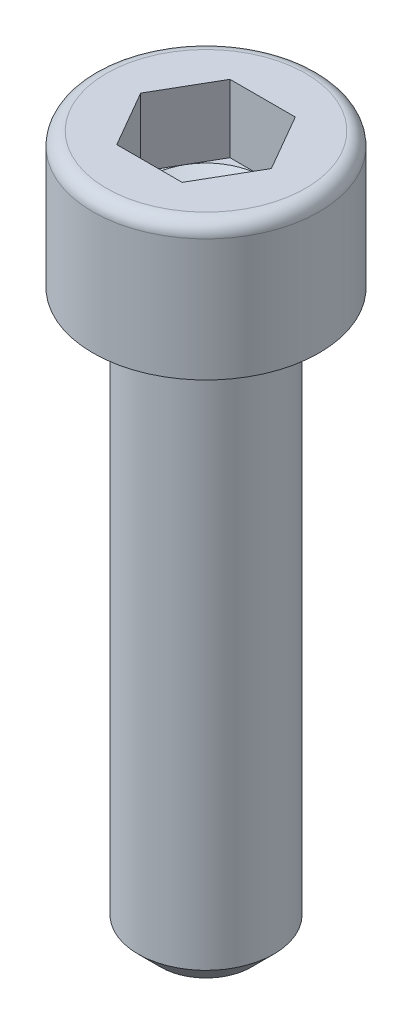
ISO-10303-21;
HEADER;
FILE_DESCRIPTION(('STEP AP214'),'2;1');
FILE_NAME('part.step','',(''),(''),'','','');
FILE_SCHEMA(('AUTOMOTIVE_DESIGN { 1 0 10303 214 1 1 1 1 }'));
ENDSEC;
DATA;
#1=APPLICATION_CONTEXT('core data for automotive mechanical design processes');
#2=APPLICATION_PROTOCOL_DEFINITION('international standard','automotive_design',2000,#1);
#3=PRODUCT_CONTEXT('',#1,'mechanical');
#4=PRODUCT('Part','Part','',(#3));
#5=PRODUCT_RELATED_PRODUCT_CATEGORY('part','',(#4));
#6=PRODUCT_DEFINITION_FORMATION('','',#4);
#7=PRODUCT_DEFINITION_CONTEXT('part definition',#1,'design');
#8=PRODUCT_DEFINITION('design','',#6,#7);
#9=PRODUCT_DEFINITION_SHAPE('','',#8);
#10=(LENGTH_UNIT() NAMED_UNIT(*) SI_UNIT(.MILLI.,.METRE.));
#11=(NAMED_UNIT(*) PLANE_ANGLE_UNIT() SI_UNIT($,.RADIAN.));
#12=(NAMED_UNIT(*) SI_UNIT($,.STERADIAN.) SOLID_ANGLE_UNIT());
#13=UNCERTAINTY_MEASURE_WITH_UNIT(LENGTH_MEASURE(1.E-05),#10,'distance_accuracy_value','');
#14=(GEOMETRIC_REPRESENTATION_CONTEXT(3) GLOBAL_UNCERTAINTY_ASSIGNED_CONTEXT((#13)) GLOBAL_UNIT_ASSIGNED_CONTEXT((#10,
#11,#12)) REPRESENTATION_CONTEXT('',''));
#15=CARTESIAN_POINT('',(0.,0.,0.));
#16=DIRECTION('',(0.,0.,1.));
#17=DIRECTION('',(1.,0.,0.));
#18=AXIS2_PLACEMENT_3D('',#15,#16,#17);
#19=CARTESIAN_POINT('',(2.5,6.,0.));
#20=DIRECTION('',(0.,-1.,0.));
#21=DIRECTION('',(1.,0.,0.));
#22=AXIS2_PLACEMENT_3D('',#19,#20,#21);
#23=PLANE('',#22);
#24=CARTESIAN_POINT('',(0.,6.,0.));
#25=DIRECTION('',(0.,1.,0.));
#26=DIRECTION('',(-1.,0.,0.));
#27=AXIS2_PLACEMENT_3D('',#24,#25,#26);
#28=CIRCLE('',#27,4.4);
#29=CARTESIAN_POINT('',(-4.4,6.,0.));
#30=VERTEX_POINT('',#29);
#31=EDGE_CURVE('E139',#30,#30,#28,.T.);
#32=ORIENTED_EDGE('',*,*,#31,.T.);
#33=EDGE_LOOP('',(#32));
#34=FACE_BOUND('',#33,.T.);
#35=DIRECTION('',(0.499999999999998,0.,0.86602540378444));
#36=VECTOR('',#35,1.);
#37=CARTESIAN_POINT('',(1.44337567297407,6.,-2.5));
#38=LINE('',#37,#36);
#39=CARTESIAN_POINT('',(1.44337567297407,6.,-2.5));
#40=VERTEX_POINT('',#39);
#41=CARTESIAN_POINT('',(2.88675134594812,6.,0.));
#42=VERTEX_POINT('',#41);
#43=EDGE_CURVE('E371',#40,#42,#38,.T.);
#44=ORIENTED_EDGE('',*,*,#43,.T.);
#45=DIRECTION('',(-0.499999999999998,0.,0.86602540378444));
#46=VECTOR('',#45,1.);
#47=CARTESIAN_POINT('',(1.44337567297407,6.,2.5));
#48=LINE('',#47,#46);
#49=CARTESIAN_POINT('',(1.44337567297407,6.,2.5));
#50=VERTEX_POINT('',#49);
#51=EDGE_CURVE('E374',#42,#50,#48,.T.);
#52=ORIENTED_EDGE('',*,*,#51,.T.);
#53=DIRECTION('',(-1.,0.,0.));
#54=VECTOR('',#53,1.);
#55=CARTESIAN_POINT('',(1.44337567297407,6.,2.5));
#56=LINE('',#55,#54);
#57=CARTESIAN_POINT('',(-1.44337567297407,6.,2.5));
#58=VERTEX_POINT('',#57);
#59=EDGE_CURVE('E377',#50,#58,#56,.T.);
#60=ORIENTED_EDGE('',*,*,#59,.T.);
#61=DIRECTION('',(-0.499999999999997,0.,-0.86602540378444));
#62=VECTOR('',#61,1.);
#63=CARTESIAN_POINT('',(-1.44337567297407,6.,2.5));
#64=LINE('',#63,#62);
#65=CARTESIAN_POINT('',(-2.88675134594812,6.,0.));
#66=VERTEX_POINT('',#65);
#67=EDGE_CURVE('E116',#58,#66,#64,.T.);
#68=ORIENTED_EDGE('',*,*,#67,.T.);
#69=DIRECTION('',(0.499999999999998,0.,-0.86602540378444));
#70=VECTOR('',#69,1.);
#71=CARTESIAN_POINT('',(-1.44337567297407,6.,-2.5));
#72=LINE('',#71,#70);
#73=CARTESIAN_POINT('',(-1.44337567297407,6.,-2.5));
#74=VERTEX_POINT('',#73);
#75=EDGE_CURVE('E368',#66,#74,#72,.T.);
#76=ORIENTED_EDGE('',*,*,#75,.T.);
#77=DIRECTION('',(1.,0.,0.));
#78=VECTOR('',#77,1.);
#79=CARTESIAN_POINT('',(1.44337567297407,6.,-2.5));
#80=LINE('',#79,#78);
#81=EDGE_CURVE('E127',#74,#40,#80,.T.);
#82=ORIENTED_EDGE('',*,*,#81,.T.);
#83=EDGE_LOOP('',(#44,#52,#60,#68,#76,#82));
#84=FACE_BOUND('',#83,.T.);
#85=ADVANCED_FACE('F33',(#34,#84),#23,.F.);
#86=CARTESIAN_POINT('',(0.,-25.,0.));
#87=DIRECTION('',(0.,1.,0.));
#88=DIRECTION('',(0.,0.,1.));
#89=AXIS2_PLACEMENT_3D('',#86,#87,#88);
#90=CYLINDRICAL_SURFACE('',#89,3.);
#91=CARTESIAN_POINT('',(0.,-24.,0.));
#92=DIRECTION('',(0.,1.,0.));
#93=DIRECTION('',(0.,0.,1.));
#94=AXIS2_PLACEMENT_3D('',#91,#92,#93);
#95=CIRCLE('',#94,3.);
#96=CARTESIAN_POINT('',(0.,-24.,3.));
#97=VERTEX_POINT('',#96);
#98=EDGE_CURVE('E41',#97,#97,#95,.T.);
#99=ORIENTED_EDGE('',*,*,#98,.T.);
#100=EDGE_LOOP('',(#99));
#101=FACE_BOUND('',#100,.T.);
#102=CARTESIAN_POINT('',(0.,0.,0.));
#103=DIRECTION('',(0.,1.,0.));
#104=DIRECTION('',(0.,0.,1.));
#105=AXIS2_PLACEMENT_3D('',#102,#103,#104);
#106=CIRCLE('',#105,3.);
#107=CARTESIAN_POINT('',(0.,0.,3.));
#108=VERTEX_POINT('',#107);
#109=EDGE_CURVE('E149',#108,#108,#106,.T.);
#110=ORIENTED_EDGE('',*,*,#109,.F.);
#111=EDGE_LOOP('',(#110));
#112=FACE_BOUND('',#111,.T.);
#113=ADVANCED_FACE('F154',(#101,#112),#90,.T.);
#114=CARTESIAN_POINT('',(0.,-25.,0.));
#115=DIRECTION('',(0.,1.,0.));
#116=DIRECTION('',(0.,0.,1.));
#117=AXIS2_PLACEMENT_3D('',#114,#115,#116);
#118=PLANE('',#117);
#119=CARTESIAN_POINT('',(0.,-25.,0.));
#120=DIRECTION('',(0.,1.,0.));
#121=DIRECTION('',(0.,0.,1.));
#122=AXIS2_PLACEMENT_3D('',#119,#120,#121);
#123=CIRCLE('',#122,2.);
#124=CARTESIAN_POINT('',(0.,-25.,2.));
#125=VERTEX_POINT('',#124);
#126=EDGE_CURVE('E11',#125,#125,#123,.F.);
#127=ORIENTED_EDGE('',*,*,#126,.T.);
#128=EDGE_LOOP('',(#127));
#129=FACE_BOUND('',#128,.T.);
#130=ADVANCED_FACE('F159',(#129),#118,.F.);
#131=CARTESIAN_POINT('',(0.,-24.,0.));
#132=DIRECTION('',(0.,1.,0.));
#133=DIRECTION('',(0.,0.,1.));
#134=AXIS2_PLACEMENT_3D('',#131,#132,#133);
#135=CONICAL_SURFACE('',#134,3.,0.78539816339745);
#136=ORIENTED_EDGE('',*,*,#126,.F.);
#137=EDGE_LOOP('',(#136));
#138=FACE_BOUND('',#137,.T.);
#139=ORIENTED_EDGE('',*,*,#98,.F.);
#140=EDGE_LOOP('',(#139));
#141=FACE_BOUND('',#140,.T.);
#142=ADVANCED_FACE('F35',(#138,#141),#135,.T.);
#143=CARTESIAN_POINT('',(0.,0.,0.));
#144=DIRECTION('',(0.,1.,0.));
#145=DIRECTION('',(-1.,0.,0.));
#146=AXIS2_PLACEMENT_3D('',#143,#144,#145);
#147=PLANE('',#146);
#148=ORIENTED_EDGE('',*,*,#109,.T.);
#149=EDGE_LOOP('',(#148));
#150=FACE_BOUND('',#149,.T.);
#151=CARTESIAN_POINT('',(0.,0.,0.));
#152=DIRECTION('',(0.,1.,0.));
#153=DIRECTION('',(-1.,0.,0.));
#154=AXIS2_PLACEMENT_3D('',#151,#152,#153);
#155=CIRCLE('',#154,5.);
#156=CARTESIAN_POINT('',(-5.,0.,0.));
#157=VERTEX_POINT('',#156);
#158=EDGE_CURVE('E146',#157,#157,#155,.T.);
#159=ORIENTED_EDGE('',*,*,#158,.F.);
#160=EDGE_LOOP('',(#159));
#161=FACE_BOUND('',#160,.T.);
#162=ADVANCED_FACE('F158',(#150,#161),#147,.F.);
#163=CARTESIAN_POINT('',(0.,6.,0.));
#164=DIRECTION('',(0.,1.,0.));
#165=DIRECTION('',(-1.,0.,0.));
#166=AXIS2_PLACEMENT_3D('',#163,#164,#165);
#167=CYLINDRICAL_SURFACE('',#166,5.);
#168=CARTESIAN_POINT('',(0.,5.4,0.));
#169=DIRECTION('',(0.,1.,0.));
#170=DIRECTION('',(-1.,0.,0.));
#171=AXIS2_PLACEMENT_3D('',#168,#169,#170);
#172=CIRCLE('',#171,5.);
#173=CARTESIAN_POINT('',(-5.,5.4,0.));
#174=VERTEX_POINT('',#173);
#175=EDGE_CURVE('E143',#174,#174,#172,.T.);
#176=ORIENTED_EDGE('',*,*,#175,.F.);
#177=EDGE_LOOP('',(#176));
#178=FACE_BOUND('',#177,.T.);
#179=ORIENTED_EDGE('',*,*,#158,.T.);
#180=EDGE_LOOP('',(#179));
#181=FACE_BOUND('',#180,.T.);
#182=ADVANCED_FACE('F165',(#178,#181),#167,.T.);
#183=CARTESIAN_POINT('',(0.,5.4,0.));
#184=DIRECTION('',(0.,1.,0.));
#185=DIRECTION('',(-1.,0.,0.));
#186=AXIS2_PLACEMENT_3D('',#183,#184,#185);
#187=TOROIDAL_SURFACE('',#186,4.4,0.6);
#188=ORIENTED_EDGE('',*,*,#31,.F.);
#189=EDGE_LOOP('',(#188));
#190=FACE_BOUND('',#189,.T.);
#191=ORIENTED_EDGE('',*,*,#175,.T.);
#192=EDGE_LOOP('',(#191));
#193=FACE_BOUND('',#192,.T.);
#194=ADVANCED_FACE('F182',(#190,#193),#187,.T.);
#195=CARTESIAN_POINT('',(-1.44337567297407,3.,-2.5));
#196=DIRECTION('',(0.86602540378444,0.,0.499999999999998));
#197=DIRECTION('',(0.499999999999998,0.,-0.86602540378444));
#198=AXIS2_PLACEMENT_3D('',#195,#196,#197);
#199=PLANE('',#198);
#200=ORIENTED_EDGE('',*,*,#75,.F.);
#201=DIRECTION('',(0.,1.,0.));
#202=VECTOR('',#201,1.);
#203=CARTESIAN_POINT('',(-2.88675134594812,3.,0.));
#204=LINE('',#203,#202);
#205=CARTESIAN_POINT('',(-2.88675134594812,3.,0.));
#206=VERTEX_POINT('',#205);
#207=EDGE_CURVE('E363',#206,#66,#204,.T.);
#208=ORIENTED_EDGE('',*,*,#207,.F.);
#209=DIRECTION('',(0.499999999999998,0.,-0.86602540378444));
#210=VECTOR('',#209,1.);
#211=CARTESIAN_POINT('',(-1.44337567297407,3.,-2.5));
#212=LINE('',#211,#210);
#213=CARTESIAN_POINT('',(-2.1650635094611,3.,-1.24999999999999));
#214=VERTEX_POINT('',#213);
#215=EDGE_CURVE('E112',#206,#214,#212,.T.);
#216=ORIENTED_EDGE('',*,*,#215,.T.);
#217=CARTESIAN_POINT('',(-1.44337567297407,3.,-2.5));
#218=VERTEX_POINT('',#217);
#219=EDGE_CURVE('E106',#214,#218,#212,.T.);
#220=ORIENTED_EDGE('',*,*,#219,.T.);
#221=DIRECTION('',(0.,1.,0.));
#222=VECTOR('',#221,1.);
#223=CARTESIAN_POINT('',(-1.44337567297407,3.,-2.5));
#224=LINE('',#223,#222);
#225=EDGE_CURVE('E108',#218,#74,#224,.T.);
#226=ORIENTED_EDGE('',*,*,#225,.T.);
#227=EDGE_LOOP('',(#200,#208,#216,#220,#226));
#228=FACE_BOUND('',#227,.T.);
#229=ADVANCED_FACE('F107',(#228),#199,.T.);
#230=CARTESIAN_POINT('',(1.44337567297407,3.,-2.5));
#231=DIRECTION('',(0.,0.,1.));
#232=DIRECTION('',(1.,0.,0.));
#233=AXIS2_PLACEMENT_3D('',#230,#231,#232);
#234=PLANE('',#233);
#235=ORIENTED_EDGE('',*,*,#81,.F.);
#236=ORIENTED_EDGE('',*,*,#225,.F.);
#237=DIRECTION('',(1.,0.,0.));
#238=VECTOR('',#237,1.);
#239=CARTESIAN_POINT('',(1.44337567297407,3.,-2.5));
#240=LINE('',#239,#238);
#241=CARTESIAN_POINT('',(0.,3.,-2.5));
#242=VERTEX_POINT('',#241);
#243=EDGE_CURVE('E48',#218,#242,#240,.T.);
#244=ORIENTED_EDGE('',*,*,#243,.T.);
#245=CARTESIAN_POINT('',(1.44337567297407,3.,-2.5));
#246=VERTEX_POINT('',#245);
#247=EDGE_CURVE('E122',#242,#246,#240,.T.);
#248=ORIENTED_EDGE('',*,*,#247,.T.);
#249=DIRECTION('',(0.,1.,0.));
#250=VECTOR('',#249,1.);
#251=CARTESIAN_POINT('',(1.44337567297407,3.,-2.5));
#252=LINE('',#251,#250);
#253=EDGE_CURVE('E129',#246,#40,#252,.T.);
#254=ORIENTED_EDGE('',*,*,#253,.T.);
#255=EDGE_LOOP('',(#235,#236,#244,#248,#254));
#256=FACE_BOUND('',#255,.T.);
#257=ADVANCED_FACE('F124',(#256),#234,.T.);
#258=CARTESIAN_POINT('',(1.44337567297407,3.,-2.5));
#259=DIRECTION('',(-0.86602540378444,0.,0.499999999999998));
#260=DIRECTION('',(0.499999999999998,0.,0.86602540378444));
#261=AXIS2_PLACEMENT_3D('',#258,#259,#260);
#262=PLANE('',#261);
#263=ORIENTED_EDGE('',*,*,#43,.F.);
#264=ORIENTED_EDGE('',*,*,#253,.F.);
#265=DIRECTION('',(0.499999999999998,0.,0.86602540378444));
#266=VECTOR('',#265,1.);
#267=CARTESIAN_POINT('',(1.44337567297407,3.,-2.5));
#268=LINE('',#267,#266);
#269=CARTESIAN_POINT('',(2.1650635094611,3.,-1.24999999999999));
#270=VERTEX_POINT('',#269);
#271=EDGE_CURVE('E396',#246,#270,#268,.T.);
#272=ORIENTED_EDGE('',*,*,#271,.T.);
#273=CARTESIAN_POINT('',(2.88675134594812,3.,0.));
#274=VERTEX_POINT('',#273);
#275=EDGE_CURVE('E121',#270,#274,#268,.T.);
#276=ORIENTED_EDGE('',*,*,#275,.T.);
#277=DIRECTION('',(0.,1.,0.));
#278=VECTOR('',#277,1.);
#279=CARTESIAN_POINT('',(2.88675134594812,3.,0.));
#280=LINE('',#279,#278);
#281=EDGE_CURVE('E134',#274,#42,#280,.T.);
#282=ORIENTED_EDGE('',*,*,#281,.T.);
#283=EDGE_LOOP('',(#263,#264,#272,#276,#282));
#284=FACE_BOUND('',#283,.T.);
#285=ADVANCED_FACE('F212',(#284),#262,.T.);
#286=CARTESIAN_POINT('',(1.44337567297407,3.,2.5));
#287=DIRECTION('',(-0.86602540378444,0.,-0.499999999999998));
#288=DIRECTION('',(-0.499999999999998,0.,0.86602540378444));
#289=AXIS2_PLACEMENT_3D('',#286,#287,#288);
#290=PLANE('',#289);
#291=ORIENTED_EDGE('',*,*,#51,.F.);
#292=ORIENTED_EDGE('',*,*,#281,.F.);
#293=DIRECTION('',(-0.499999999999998,0.,0.86602540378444));
#294=VECTOR('',#293,1.);
#295=CARTESIAN_POINT('',(1.44337567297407,3.,2.5));
#296=LINE('',#295,#294);
#297=CARTESIAN_POINT('',(2.1650635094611,3.,1.24999999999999));
#298=VERTEX_POINT('',#297);
#299=EDGE_CURVE('E394',#274,#298,#296,.T.);
#300=ORIENTED_EDGE('',*,*,#299,.T.);
#301=CARTESIAN_POINT('',(1.44337567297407,3.,2.5));
#302=VERTEX_POINT('',#301);
#303=EDGE_CURVE('E395',#298,#302,#296,.T.);
#304=ORIENTED_EDGE('',*,*,#303,.T.);
#305=DIRECTION('',(0.,1.,0.));
#306=VECTOR('',#305,1.);
#307=CARTESIAN_POINT('',(1.44337567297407,3.,2.5));
#308=LINE('',#307,#306);
#309=EDGE_CURVE('E383',#302,#50,#308,.T.);
#310=ORIENTED_EDGE('',*,*,#309,.T.);
#311=EDGE_LOOP('',(#291,#292,#300,#304,#310));
#312=FACE_BOUND('',#311,.T.);
#313=ADVANCED_FACE('F219',(#312),#290,.T.);
#314=CARTESIAN_POINT('',(1.44337567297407,3.,2.5));
#315=DIRECTION('',(0.,0.,-1.));
#316=DIRECTION('',(-1.,0.,0.));
#317=AXIS2_PLACEMENT_3D('',#314,#315,#316);
#318=PLANE('',#317);
#319=ORIENTED_EDGE('',*,*,#59,.F.);
#320=ORIENTED_EDGE('',*,*,#309,.F.);
#321=DIRECTION('',(-1.,0.,0.));
#322=VECTOR('',#321,1.);
#323=CARTESIAN_POINT('',(1.44337567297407,3.,2.5));
#324=LINE('',#323,#322);
#325=CARTESIAN_POINT('',(0.,3.,2.5));
#326=VERTEX_POINT('',#325);
#327=EDGE_CURVE('E358',#302,#326,#324,.T.);
#328=ORIENTED_EDGE('',*,*,#327,.T.);
#329=CARTESIAN_POINT('',(-1.44337567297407,3.,2.5));
#330=VERTEX_POINT('',#329);
#331=EDGE_CURVE('E354',#326,#330,#324,.T.);
#332=ORIENTED_EDGE('',*,*,#331,.T.);
#333=DIRECTION('',(0.,1.,0.));
#334=VECTOR('',#333,1.);
#335=CARTESIAN_POINT('',(-1.44337567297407,3.,2.5));
#336=LINE('',#335,#334);
#337=EDGE_CURVE('E362',#330,#58,#336,.T.);
#338=ORIENTED_EDGE('',*,*,#337,.T.);
#339=EDGE_LOOP('',(#319,#320,#328,#332,#338));
#340=FACE_BOUND('',#339,.T.);
#341=ADVANCED_FACE('F227',(#340),#318,.T.);
#342=CARTESIAN_POINT('',(-1.44337567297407,3.,2.5));
#343=DIRECTION('',(0.86602540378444,0.,-0.499999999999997));
#344=DIRECTION('',(-0.499999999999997,0.,-0.86602540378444));
#345=AXIS2_PLACEMENT_3D('',#342,#343,#344);
#346=PLANE('',#345);
#347=ORIENTED_EDGE('',*,*,#67,.F.);
#348=ORIENTED_EDGE('',*,*,#337,.F.);
#349=DIRECTION('',(-0.499999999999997,0.,-0.86602540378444));
#350=VECTOR('',#349,1.);
#351=CARTESIAN_POINT('',(-1.44337567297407,3.,2.5));
#352=LINE('',#351,#350);
#353=CARTESIAN_POINT('',(-2.1650635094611,3.,1.24999999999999));
#354=VERTEX_POINT('',#353);
#355=EDGE_CURVE('E353',#330,#354,#352,.T.);
#356=ORIENTED_EDGE('',*,*,#355,.T.);
#357=EDGE_CURVE('E356',#354,#206,#352,.T.);
#358=ORIENTED_EDGE('',*,*,#357,.T.);
#359=ORIENTED_EDGE('',*,*,#207,.T.);
#360=EDGE_LOOP('',(#347,#348,#356,#358,#359));
#361=FACE_BOUND('',#360,.T.);
#362=ADVANCED_FACE('F235',(#361),#346,.T.);
#363=CARTESIAN_POINT('',(-4.33012701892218,3.,2.5));
#364=DIRECTION('',(0.,-1.,0.));
#365=DIRECTION('',(0.,0.,-1.));
#366=AXIS2_PLACEMENT_3D('',#363,#364,#365);
#367=PLANE('',#366);
#368=ORIENTED_EDGE('',*,*,#243,.F.);
#369=ORIENTED_EDGE('',*,*,#219,.F.);
#370=CARTESIAN_POINT('',(0.,3.,0.));
#371=DIRECTION('',(0.,1.,0.));
#372=DIRECTION('',(-1.,0.,0.));
#373=AXIS2_PLACEMENT_3D('',#370,#371,#372);
#374=CIRCLE('',#373,2.5);
#375=EDGE_CURVE('E119',#242,#214,#374,.T.);
#376=ORIENTED_EDGE('',*,*,#375,.F.);
#377=EDGE_LOOP('',(#368,#369,#376));
#378=FACE_BOUND('',#377,.T.);
#379=ADVANCED_FACE('F118',(#378),#367,.F.);
#380=ORIENTED_EDGE('',*,*,#215,.F.);
#381=ORIENTED_EDGE('',*,*,#357,.F.);
#382=EDGE_CURVE('E128',#214,#354,#374,.T.);
#383=ORIENTED_EDGE('',*,*,#382,.F.);
#384=EDGE_LOOP('',(#380,#381,#383));
#385=FACE_BOUND('',#384,.T.);
#386=ADVANCED_FACE('F250',(#385),#367,.F.);
#387=ORIENTED_EDGE('',*,*,#355,.F.);
#388=ORIENTED_EDGE('',*,*,#331,.F.);
#389=EDGE_CURVE('E133',#354,#326,#374,.T.);
#390=ORIENTED_EDGE('',*,*,#389,.F.);
#391=EDGE_LOOP('',(#387,#388,#390));
#392=FACE_BOUND('',#391,.T.);
#393=ADVANCED_FACE('F258',(#392),#367,.F.);
#394=ORIENTED_EDGE('',*,*,#327,.F.);
#395=ORIENTED_EDGE('',*,*,#303,.F.);
#396=EDGE_CURVE('E140',#326,#298,#374,.T.);
#397=ORIENTED_EDGE('',*,*,#396,.F.);
#398=EDGE_LOOP('',(#394,#395,#397));
#399=FACE_BOUND('',#398,.T.);
#400=ADVANCED_FACE('F265',(#399),#367,.F.);
#401=ORIENTED_EDGE('',*,*,#299,.F.);
#402=ORIENTED_EDGE('',*,*,#275,.F.);
#403=EDGE_CURVE('E400',#298,#270,#374,.T.);
#404=ORIENTED_EDGE('',*,*,#403,.F.);
#405=EDGE_LOOP('',(#401,#402,#404));
#406=FACE_BOUND('',#405,.T.);
#407=ADVANCED_FACE('F272',(#406),#367,.F.);
#408=ORIENTED_EDGE('',*,*,#271,.F.);
#409=ORIENTED_EDGE('',*,*,#247,.F.);
#410=EDGE_CURVE('E399',#270,#242,#374,.T.);
#411=ORIENTED_EDGE('',*,*,#410,.F.);
#412=EDGE_LOOP('',(#408,#409,#411));
#413=FACE_BOUND('',#412,.T.);
#414=ADVANCED_FACE('F252',(#413),#367,.F.);
#415=CARTESIAN_POINT('',(0.,3.,0.));
#416=DIRECTION('',(0.,1.,0.));
#417=DIRECTION('',(-1.,0.,0.));
#418=AXIS2_PLACEMENT_3D('',#415,#416,#417);
#419=CONICAL_SURFACE('',#418,2.5,1.04719755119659);
#420=CARTESIAN_POINT('',(0.,1.55662432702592,0.));
#421=VERTEX_POINT('',#420);
#422=VERTEX_LOOP('',#421);
#423=FACE_BOUND('',#422,.T.);
#424=ORIENTED_EDGE('',*,*,#389,.T.);
#425=ORIENTED_EDGE('',*,*,#396,.T.);
#426=ORIENTED_EDGE('',*,*,#403,.T.);
#427=ORIENTED_EDGE('',*,*,#410,.T.);
#428=ORIENTED_EDGE('',*,*,#375,.T.);
#429=ORIENTED_EDGE('',*,*,#382,.T.);
#430=EDGE_LOOP('',(#424,#425,#426,#427,#428,#429));
#431=FACE_BOUND('',#430,.T.);
#432=ADVANCED_FACE('F180',(#423,#431),#419,.F.);
#433=CLOSED_SHELL('',(#85,#113,#130,#142,#162,#182,#194,#229,#257,#285,#313,#341,#362,#379,#386,
#393,#400,#407,#414,#432));
#434=MANIFOLD_SOLID_BREP('B2',#433);
#435=ADVANCED_BREP_SHAPE_REPRESENTATION('',(#18,#434),#14);
#436=SHAPE_DEFINITION_REPRESENTATION(#9,#435);
ENDSEC;
END-ISO-10303-21;
